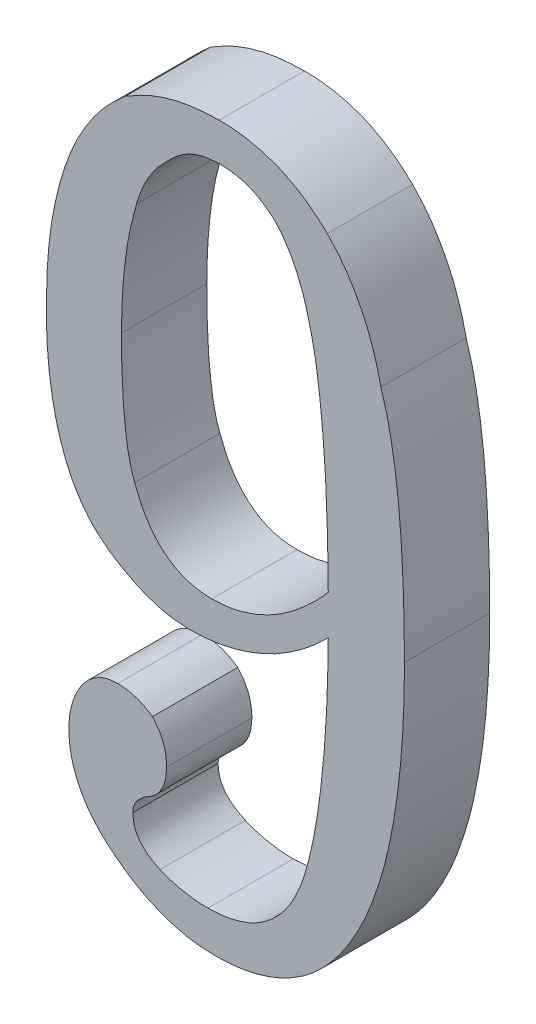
from build123d import *

# Parameters (mm, degrees)
EXTRUDE_1_DEPTH = 3


with BuildPart() as part:
    # Sketch 1 → Extrude 1 (new body)
    with BuildSketch(Plane.XY):
        with BuildLine():
            add(Edge.make_bspline(
                [(12.169312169, 10.087203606), (11.98800475, 9.912062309), (11.634127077, 9.570219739), (11.058357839, 9.128355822), (10.472863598, 8.747379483), (9.863557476, 8.442492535), (9.24085993, 8.200049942), (8.600276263, 8.028715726), (7.943402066, 7.921337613), (7.499267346, 7.90862824), (7.275132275, 7.902214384)],
                knots=[0, 0, 0, 0, 1.097910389, 2.142912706, 3.157737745, 4.138132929, 5.107014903, 6.06525022, 7.023617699, 8, 8, 8, 8], degree=3))
            add(Edge.make_bspline(
                [(7.275132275, 7.902214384), (7.046912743, 7.913488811), (6.580238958, 7.936543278), (5.883070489, 8.13343965), (5.174439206, 8.430425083), (4.728685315, 8.714834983), (4.497354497, 8.862433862)],
                knots=[0, 0, 0, 0, 0.917145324, 1.8754209, 2.897417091, 4, 4, 4, 4], degree=3))
            add(Edge.make_bspline(
                [(4.497354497, 8.862433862), (4.314760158, 8.999419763), (3.943368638, 9.278045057), (3.491377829, 9.834437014), (3.097567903, 10.478398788), (2.790111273, 11.231255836), (2.544787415, 12.081961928), (2.374478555, 13.03417749), (2.264321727, 14.088801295), (2.25405122, 14.825938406), (2.248677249, 15.211640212)],
                knots=[0, 0, 0, 0, 0.780425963, 1.587363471, 2.439545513, 3.363447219, 4.36687373, 5.472210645, 6.677352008, 8, 8, 8, 8], degree=3))
            add(Edge.make_bspline(
                [(2.248677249, 15.211640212), (2.257166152, 15.65447114), (2.273555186, 16.509419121), (2.39778333, 17.742570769), (2.618168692, 18.875316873), (2.919464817, 19.908521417), (3.303187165, 20.845665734), (3.788207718, 21.673168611), (4.351378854, 22.409964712), (4.802542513, 22.814902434), (5.026455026, 23.015873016)],
                knots=[0, 0, 0, 0, 1.241888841, 2.397642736, 3.471036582, 4.47389864, 5.412113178, 6.302914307, 7.157736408, 8, 8, 8, 8], degree=3))
            add(Edge.make_bspline(
                [(5.026455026, 23.015873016), (5.274056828, 23.159469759), (5.767005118, 23.445355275), (6.580877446, 23.732323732), (7.440541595, 23.908695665), (8.031973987, 23.930625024), (8.333333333, 23.941798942)],
                knots=[0, 0, 0, 0, 0.985359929, 1.961744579, 2.961424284, 4, 4, 4, 4], degree=3))
            add(Edge.make_bspline(
                [(8.333333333, 23.941798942), (8.514840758, 23.937201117), (8.872846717, 23.928132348), (9.399811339, 23.852907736), (9.905764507, 23.728832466), (10.395735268, 23.564561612), (10.860652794, 23.339827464), (11.311422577, 23.07563662), (11.737598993, 22.755440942), (12.001505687, 22.511966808), (12.135018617, 22.388790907)],
                knots=[0, 0, 0, 0, 1.032934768, 2.037364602, 3.022683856, 3.995779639, 4.97299638, 5.956691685, 6.966270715, 8, 8, 8, 8], degree=3))
            add(Edge.make_bspline(
                [(12.135018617, 22.388790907), (12.247907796, 22.267938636), (12.475223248, 22.024588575), (12.784108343, 21.627933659), (13.058401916, 21.197585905), (13.306740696, 20.741685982), (13.53605625, 20.261658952), (13.723461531, 19.748110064), (13.892745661, 19.211081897), (13.977965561, 18.839268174), (14.021164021, 18.650793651)],
                knots=[0, 0, 0, 0, 0.934991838, 1.882714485, 2.838279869, 3.817867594, 4.81770845, 5.843530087, 6.906872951, 8, 8, 8, 8], degree=3))
            add(Edge.make_bspline(
                [(14.021164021, 18.650793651), (14.089759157, 18.42630012), (14.234579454, 17.952342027), (14.394704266, 17.182914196), (14.5361413, 16.324817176), (14.653248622, 15.373676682), (14.738369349, 14.329193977), (14.801029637, 13.193838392), (14.840373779, 11.967089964), (14.846127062, 11.119306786), (14.849108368, 10.679992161)],
                knots=[0, 0, 0, 0, 0.700248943, 1.478388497, 2.342911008, 3.295609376, 4.337399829, 5.469863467, 6.688903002, 8, 8, 8, 8], degree=3))
            add(Edge.make_bspline(
                [(14.849108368, 10.679992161), (14.847816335, 10.364776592), (14.845285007, 9.747211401), (14.808108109, 8.839093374), (14.75747502, 7.968047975), (14.677264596, 7.135126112), (14.581578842, 6.338933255), (14.458043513, 5.579453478), (14.316258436, 4.855627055), (14.15894475, 4.167001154), (13.962693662, 3.520854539), (13.760459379, 2.90557333), (13.53084464, 2.327589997), (13.275909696, 1.788293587), (13.000247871, 1.286512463), (12.707842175, 0.819263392), (12.388820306, 0.38938812), (12.153458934, 0.12886714), (12.037037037, 0)],
                knots=[0, 0, 0, 0, 1.340386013, 2.626062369, 3.864565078, 5.050369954, 6.183941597, 7.274270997, 8.321621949, 9.320515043, 10.276380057, 11.192150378, 12.074228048, 12.919193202, 13.727281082, 14.507587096, 15.261775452, 16, 16, 16, 16], degree=3))
            add(Edge.make_bspline(
                [(12.037037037, 0), (11.908863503, -0.126820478), (11.655687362, -0.377323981), (11.237117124, -0.701972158), (10.790314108, -0.973025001), (10.322177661, -1.199804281), (9.824681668, -1.370815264), (9.307179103, -1.499434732), (8.761708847, -1.573796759), (8.390712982, -1.582733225), (8.201058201, -1.587301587)],
                knots=[0, 0, 0, 0, 1.012219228, 1.999396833, 2.966944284, 3.943451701, 4.915337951, 5.916523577, 6.934917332, 8, 8, 8, 8], degree=3))
            add(Edge.make_bspline(
                [(8.201058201, -1.587301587), (8.042494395, -1.583478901), (7.727535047, -1.575885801), (7.259690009, -1.51661278), (6.802858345, -1.412197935), (6.355245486, -1.270022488), (5.916829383, -1.086402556), (5.486637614, -0.867214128), (5.065107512, -0.605210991), (4.799483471, -0.402365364), (4.663923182, -0.298843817)],
                knots=[0, 0, 0, 0, 0.99128981, 1.96902433, 2.942537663, 3.917763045, 4.901927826, 5.911145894, 6.93396071, 8, 8, 8, 8], degree=3))
            add(Edge.make_bspline(
                [(4.663923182, -0.298843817), (4.533923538, -0.193946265), (4.280641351, 0.010428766), (3.953298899, 0.357980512), (3.668482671, 0.715183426), (3.443576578, 1.095893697), (3.263614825, 1.491216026), (3.13772698, 1.904642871), (3.054341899, 2.335151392), (3.046372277, 2.62877609), (3.042328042, 2.777777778)],
                knots=[0, 0, 0, 0, 1.109647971, 2.161960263, 3.167798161, 4.141885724, 5.094610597, 6.049561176, 7.010237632, 8, 8, 8, 8], degree=3))
            add(Edge.make_bspline(
                [(3.042328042, 2.777777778), (3.047789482, 2.913869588), (3.058696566, 3.185659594), (3.152937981, 3.58365403), (3.29117994, 3.973588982), (3.434777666, 4.210440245), (3.507740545, 4.330785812)],
                knots=[0, 0, 0, 0, 0.992539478, 1.982208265, 2.974747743, 4, 4, 4, 4], degree=3))
            add(Edge.make_bspline(
                [(3.507740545, 4.330785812), (3.59145421, 4.431920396), (3.752684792, 4.626703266), (4.062083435, 4.834253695), (4.399338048, 4.974117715), (4.639645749, 4.986077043), (4.761904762, 4.992161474)],
                knots=[0, 0, 0, 0, 1.065205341, 2.051560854, 3.008711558, 4, 4, 4, 4], degree=3))
            add(Edge.make_bspline(
                [(4.761904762, 4.992161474), (4.870067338, 4.98738953), (5.085649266, 4.977878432), (5.402735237, 4.902821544), (5.705102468, 4.772529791), (5.89176084, 4.655065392), (5.986674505, 4.595336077)],
                knots=[0, 0, 0, 0, 0.992215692, 1.977613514, 2.971639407, 4, 4, 4, 4], degree=3))
            add(Edge.make_bspline(
                [(5.986674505, 4.595336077), (6.062386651, 4.504894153), (6.212395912, 4.325700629), (6.368705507, 4.011339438), (6.467706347, 3.668878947), (6.476793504, 3.430075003), (6.481481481, 3.306878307)],
                knots=[0, 0, 0, 0, 0.998320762, 1.977983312, 2.956860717, 4, 4, 4, 4], degree=3))
            add(Edge.make_bspline(
                [(6.481481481, 3.306878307), (6.473119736, 3.163282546), (6.457257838, 2.890887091), (6.308724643, 2.517735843), (6.065161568, 2.208602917), (5.83884037, 2.083128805), (5.722124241, 2.018420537)],
                knots=[0, 0, 0, 0, 1.083905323, 2.056125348, 2.997524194, 4, 4, 4, 4], degree=3))
            add(Edge.make_bspline(
                [(5.722124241, 2.018420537), (5.658227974, 1.968284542), (5.537681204, 1.873697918), (5.393403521, 1.706043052), (5.31074043, 1.517302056), (5.297536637, 1.387137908), (5.291005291, 1.322751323)],
                knots=[0, 0, 0, 0, 1.14537259, 2.160861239, 3.090257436, 4, 4, 4, 4], degree=3))
            add(Edge.make_bspline(
                [(5.291005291, 1.322751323), (5.301160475, 1.191221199), (5.321265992, 0.930814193), (5.522731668, 0.576263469), (5.836112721, 0.276503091), (6.105948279, 0.141351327), (6.25122477, 0.068587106)],
                knots=[0, 0, 0, 0, 0.934452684, 1.850055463, 2.842493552, 4, 4, 4, 4], degree=3))
            add(Edge.make_bspline(
                [(6.25122477, 0.068587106), (6.384084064, 0.016314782), (6.650168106, -0.088373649), (7.069070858, -0.186373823), (7.498194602, -0.25527476), (7.789246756, -0.261433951), (7.936507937, -0.264550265)],
                knots=[0, 0, 0, 0, 0.989618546, 1.981959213, 2.97894908, 4, 4, 4, 4], degree=3))
            add(Edge.make_bspline(
                [(7.936507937, -0.264550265), (8.149808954, -0.255785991), (8.561895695, -0.23885386), (9.150752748, -0.089509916), (9.692862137, 0.139864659), (9.998449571, 0.376674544), (10.150891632, 0.494806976)],
                knots=[0, 0, 0, 0, 1.069323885, 2.065879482, 3.035165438, 4, 4, 4, 4], degree=3))
            add(Edge.make_bspline(
                [(10.150891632, 0.494806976), (10.301047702, 0.639654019), (10.611504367, 0.939133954), (10.968209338, 1.516492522), (11.272060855, 2.187552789), (11.40423288, 2.683762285), (11.473642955, 2.944346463)],
                knots=[0, 0, 0, 0, 0.882388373, 1.824390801, 2.857479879, 4, 4, 4, 4], degree=3))
            add(Edge.make_bspline(
                [(11.473642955, 2.944346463), (11.527912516, 3.170896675), (11.640987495, 3.642932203), (11.776250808, 4.386932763), (11.885377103, 5.191761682), (11.984850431, 6.053955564), (12.061649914, 6.97709198), (12.121515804, 7.960350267), (12.152783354, 9.004334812), (12.163703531, 9.719759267), (12.169312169, 10.087203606)],
                knots=[0, 0, 0, 0, 0.77724432, 1.619450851, 2.521856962, 3.487079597, 4.515223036, 5.61245225, 6.773747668, 8, 8, 8, 8], degree=3))
        make_face()
        with BuildLine():
            add(Edge.make_bspline(
                [(8.333333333, 22.619047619), (8.162340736, 22.608255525), (7.824846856, 22.586954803), (7.338308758, 22.42909739), (6.890901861, 22.164355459), (6.643189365, 21.917880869), (6.515775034, 21.791103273)],
                knots=[0, 0, 0, 0, 0.996683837, 1.967188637, 2.95439551, 4, 4, 4, 4], degree=3))
            add(Edge.make_bspline(
                [(6.515775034, 21.791103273), (6.389260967, 21.660599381), (6.138324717, 21.401749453), (5.833155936, 20.952860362), (5.589540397, 20.464430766), (5.479153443, 20.115742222), (5.423280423, 19.939251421)],
                knots=[0, 0, 0, 0, 1.00092387, 1.985297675, 2.980246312, 4, 4, 4, 4], degree=3))
            add(Edge.make_bspline(
                [(5.423280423, 19.939251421), (5.341203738, 19.635060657), (5.170251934, 19.001482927), (5.011921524, 17.990659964), (4.912989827, 16.894036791), (4.900602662, 16.134540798), (4.894179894, 15.740740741)],
                knots=[0, 0, 0, 0, 0.889988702, 1.853695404, 2.887137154, 4, 4, 4, 4], degree=3))
            add(Edge.make_bspline(
                [(4.894179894, 15.740740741), (4.893937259, 15.485949), (4.89347363, 14.999092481), (4.922325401, 14.300230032), (4.950935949, 13.664186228), (5.007730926, 13.091171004), (5.068467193, 12.580735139), (5.14518142, 12.131908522), (5.239835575, 11.74666123), (5.322022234, 11.515586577), (5.359592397, 11.409954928)],
                knots=[0, 0, 0, 0, 1.397384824, 2.670125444, 3.836275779, 4.888914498, 5.827734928, 6.655362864, 7.385323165, 8, 8, 8, 8], degree=3))
            add(Edge.make_bspline(
                [(5.359592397, 11.409954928), (5.427185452, 11.236555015), (5.556196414, 10.905596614), (5.810143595, 10.457431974), (6.097196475, 10.078241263), (6.422118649, 9.765919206), (6.782982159, 9.52247822), (7.181362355, 9.349438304), (7.614200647, 9.243153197), (7.914660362, 9.231132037), (8.068783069, 9.224965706)],
                knots=[0, 0, 0, 0, 1.193475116, 2.27791703, 3.294842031, 4.236523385, 5.158211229, 6.073617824, 7.011850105, 8, 8, 8, 8], degree=3))
            add(Edge.make_bspline(
                [(8.068783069, 9.224965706), (8.247331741, 9.231212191), (8.606053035, 9.243761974), (9.137736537, 9.35752587), (9.663100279, 9.536752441), (10.182598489, 9.782818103), (10.696262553, 10.098493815), (11.195416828, 10.49311362), (11.699129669, 10.946107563), (12.009266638, 11.294075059), (12.169312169, 11.473642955)],
                knots=[0, 0, 0, 0, 0.887157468, 1.78238387, 2.691649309, 3.643591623, 4.635447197, 5.68335335, 6.804499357, 8, 8, 8, 8], degree=3))
            add(Edge.make_bspline(
                [(12.169312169, 11.473642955), (12.16611907, 11.89009679), (12.159957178, 12.693749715), (12.123501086, 13.854892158), (12.077632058, 14.929855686), (12.00796063, 15.9195437), (11.926745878, 16.824736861), (11.82864605, 17.643143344), (11.721125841, 18.376606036), (11.622885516, 18.832481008), (11.576523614, 19.047619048)],
                knots=[0, 0, 0, 0, 1.313420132, 2.534576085, 3.663669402, 4.70652785, 5.663349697, 6.529597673, 7.306082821, 8, 8, 8, 8], degree=3))
            add(Edge.make_bspline(
                [(11.576523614, 19.047619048), (11.538331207, 19.207890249), (11.464313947, 19.518497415), (11.340532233, 19.965459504), (11.190582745, 20.374714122), (11.030398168, 20.751641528), (10.855650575, 21.097932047), (10.657468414, 21.404371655), (10.454279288, 21.685433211), (10.296676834, 21.845146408), (10.219478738, 21.923378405)],
                knots=[0, 0, 0, 0, 1.226484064, 2.376938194, 3.449763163, 4.468107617, 5.424957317, 6.332102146, 7.183016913, 8, 8, 8, 8], degree=3))
            add(Edge.make_bspline(
                [(10.219478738, 21.923378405), (10.084109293, 22.029798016), (9.816964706, 22.239811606), (9.356721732, 22.46384035), (8.856518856, 22.59399783), (8.510479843, 22.610565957), (8.333333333, 22.619047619)],
                knots=[0, 0, 0, 0, 1.003608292, 1.980568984, 2.966199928, 4, 4, 4, 4], degree=3))
        make_face(mode=Mode.SUBTRACT)
    extrude(amount=EXTRUDE_1_DEPTH)


solid = part.part
